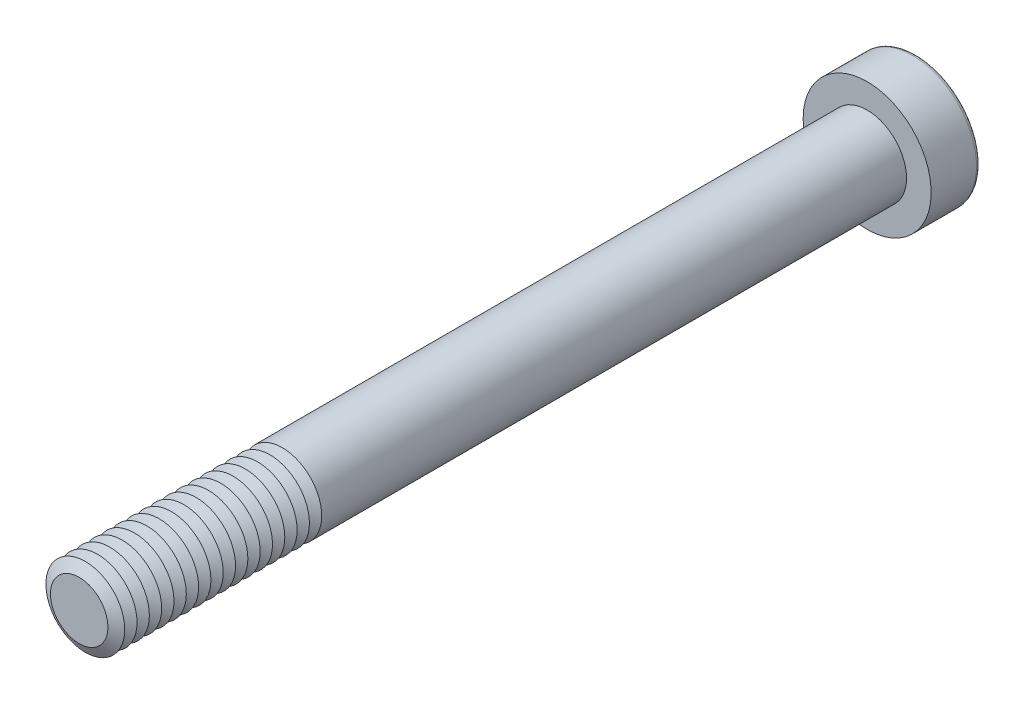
ISO-10303-21;
HEADER;
FILE_DESCRIPTION(('STEP AP214'),'2;1');
FILE_NAME('part.step','',(''),(''),'','','');
FILE_SCHEMA(('AUTOMOTIVE_DESIGN { 1 0 10303 214 1 1 1 1 }'));
ENDSEC;
DATA;
#1=APPLICATION_CONTEXT('core data for automotive mechanical design processes');
#2=APPLICATION_PROTOCOL_DEFINITION('international standard','automotive_design',2000,#1);
#3=PRODUCT_CONTEXT('',#1,'mechanical');
#4=PRODUCT('Part','Part','',(#3));
#5=PRODUCT_RELATED_PRODUCT_CATEGORY('part','',(#4));
#6=PRODUCT_DEFINITION_FORMATION('','',#4);
#7=PRODUCT_DEFINITION_CONTEXT('part definition',#1,'design');
#8=PRODUCT_DEFINITION('design','',#6,#7);
#9=PRODUCT_DEFINITION_SHAPE('','',#8);
#10=(LENGTH_UNIT() NAMED_UNIT(*) SI_UNIT(.MILLI.,.METRE.));
#11=(NAMED_UNIT(*) PLANE_ANGLE_UNIT() SI_UNIT($,.RADIAN.));
#12=(NAMED_UNIT(*) SI_UNIT($,.STERADIAN.) SOLID_ANGLE_UNIT());
#13=UNCERTAINTY_MEASURE_WITH_UNIT(LENGTH_MEASURE(1.E-05),#10,'distance_accuracy_value','');
#14=(GEOMETRIC_REPRESENTATION_CONTEXT(3) GLOBAL_UNCERTAINTY_ASSIGNED_CONTEXT((#13)) GLOBAL_UNIT_ASSIGNED_CONTEXT((#10,
#11,#12)) REPRESENTATION_CONTEXT('',''));
#15=CARTESIAN_POINT('',(0.,0.,0.));
#16=DIRECTION('',(0.,0.,1.));
#17=DIRECTION('',(1.,0.,0.));
#18=AXIS2_PLACEMENT_3D('',#15,#16,#17);
#19=CARTESIAN_POINT('',(0.,0.,75.625));
#20=DIRECTION('',(0.,0.,1.));
#21=DIRECTION('',(1.,0.,0.));
#22=AXIS2_PLACEMENT_3D('',#19,#20,#21);
#23=CONICAL_SURFACE('',#22,4.,1.0471975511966);
#24=CARTESIAN_POINT('',(0.,0.,75.));
#25=DIRECTION('',(0.,0.,1.));
#26=DIRECTION('',(1.,0.,0.));
#27=AXIS2_PLACEMENT_3D('',#24,#25,#26);
#28=CIRCLE('',#27,2.91746824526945);
#29=CARTESIAN_POINT('',(2.91746824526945,0.,75.));
#30=VERTEX_POINT('',#29);
#31=EDGE_CURVE('E314',#30,#30,#28,.T.);
#32=ORIENTED_EDGE('',*,*,#31,.T.);
#33=EDGE_LOOP('',(#32));
#34=FACE_BOUND('',#33,.T.);
#35=CARTESIAN_POINT('',(0.,0.,75.625));
#36=DIRECTION('',(0.,0.,1.));
#37=DIRECTION('',(1.,0.,0.));
#38=AXIS2_PLACEMENT_3D('',#35,#36,#37);
#39=CIRCLE('',#38,4.);
#40=CARTESIAN_POINT('',(4.,0.,75.625));
#41=VERTEX_POINT('',#40);
#42=EDGE_CURVE('E317',#41,#41,#39,.T.);
#43=ORIENTED_EDGE('',*,*,#42,.F.);
#44=EDGE_LOOP('',(#43));
#45=FACE_BOUND('',#44,.T.);
#46=ADVANCED_FACE('F39',(#34,#45),#23,.T.);
#47=CARTESIAN_POINT('',(0.,0.,75.));
#48=DIRECTION('',(0.,0.,-1.));
#49=DIRECTION('',(-1.,0.,0.));
#50=AXIS2_PLACEMENT_3D('',#47,#48,#49);
#51=CONICAL_SURFACE('',#50,2.91746824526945,1.0471975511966);
#52=CARTESIAN_POINT('',(0.,0.,74.375));
#53=DIRECTION('',(0.,0.,1.));
#54=DIRECTION('',(1.,0.,0.));
#55=AXIS2_PLACEMENT_3D('',#52,#53,#54);
#56=CIRCLE('',#55,4.);
#57=CARTESIAN_POINT('',(4.,0.,74.375));
#58=VERTEX_POINT('',#57);
#59=EDGE_CURVE('E325',#58,#58,#56,.T.);
#60=ORIENTED_EDGE('',*,*,#59,.T.);
#61=EDGE_LOOP('',(#60));
#62=FACE_BOUND('',#61,.T.);
#63=ORIENTED_EDGE('',*,*,#31,.F.);
#64=EDGE_LOOP('',(#63));
#65=FACE_BOUND('',#64,.T.);
#66=ADVANCED_FACE('F245',(#62,#65),#51,.T.);
#67=CARTESIAN_POINT('',(0.,0.,80.));
#68=DIRECTION('',(0.,0.,1.));
#69=DIRECTION('',(1.,0.,0.));
#70=AXIS2_PLACEMENT_3D('',#67,#68,#69);
#71=PLANE('',#70);
#72=CARTESIAN_POINT('',(0.,0.,80.));
#73=DIRECTION('',(0.,0.,1.));
#74=DIRECTION('',(1.,0.,0.));
#75=AXIS2_PLACEMENT_3D('',#72,#73,#74);
#76=CIRCLE('',#75,2.91746824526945);
#77=CARTESIAN_POINT('',(2.91746824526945,0.,80.));
#78=VERTEX_POINT('',#77);
#79=EDGE_CURVE('E174',#78,#78,#76,.T.);
#80=ORIENTED_EDGE('',*,*,#79,.T.);
#81=EDGE_LOOP('',(#80));
#82=FACE_BOUND('',#81,.T.);
#83=ADVANCED_FACE('F251',(#82),#71,.T.);
#84=CARTESIAN_POINT('',(0.,0.,80.));
#85=DIRECTION('',(0.,0.,-1.));
#86=DIRECTION('',(-1.,0.,0.));
#87=AXIS2_PLACEMENT_3D('',#84,#85,#86);
#88=CONICAL_SURFACE('',#87,2.91746824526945,1.0471975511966);
#89=CARTESIAN_POINT('',(0.,0.,79.375));
#90=DIRECTION('',(0.,0.,1.));
#91=DIRECTION('',(1.,0.,0.));
#92=AXIS2_PLACEMENT_3D('',#89,#90,#91);
#93=CIRCLE('',#92,4.);
#94=CARTESIAN_POINT('',(4.,0.,79.375));
#95=VERTEX_POINT('',#94);
#96=EDGE_CURVE('E291',#95,#95,#93,.T.);
#97=ORIENTED_EDGE('',*,*,#96,.T.);
#98=EDGE_LOOP('',(#97));
#99=FACE_BOUND('',#98,.T.);
#100=ORIENTED_EDGE('',*,*,#79,.F.);
#101=EDGE_LOOP('',(#100));
#102=FACE_BOUND('',#101,.T.);
#103=ADVANCED_FACE('F199',(#99,#102),#88,.T.);
#104=CARTESIAN_POINT('',(0.,0.,79.375));
#105=DIRECTION('',(0.,0.,1.));
#106=DIRECTION('',(1.,0.,0.));
#107=AXIS2_PLACEMENT_3D('',#104,#105,#106);
#108=CONICAL_SURFACE('',#107,4.,1.0471975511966);
#109=CARTESIAN_POINT('',(0.,0.,78.75));
#110=DIRECTION('',(0.,0.,1.));
#111=DIRECTION('',(1.,0.,0.));
#112=AXIS2_PLACEMENT_3D('',#109,#110,#111);
#113=CIRCLE('',#112,2.91746824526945);
#114=CARTESIAN_POINT('',(2.91746824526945,0.,78.75));
#115=VERTEX_POINT('',#114);
#116=EDGE_CURVE('E288',#115,#115,#113,.T.);
#117=ORIENTED_EDGE('',*,*,#116,.T.);
#118=EDGE_LOOP('',(#117));
#119=FACE_BOUND('',#118,.T.);
#120=ORIENTED_EDGE('',*,*,#96,.F.);
#121=EDGE_LOOP('',(#120));
#122=FACE_BOUND('',#121,.T.);
#123=ADVANCED_FACE('F277',(#119,#122),#108,.T.);
#124=CARTESIAN_POINT('',(0.,0.,78.75));
#125=DIRECTION('',(0.,0.,-1.));
#126=DIRECTION('',(-1.,0.,0.));
#127=AXIS2_PLACEMENT_3D('',#124,#125,#126);
#128=CONICAL_SURFACE('',#127,2.91746824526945,1.0471975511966);
#129=CARTESIAN_POINT('',(0.,0.,78.125));
#130=DIRECTION('',(0.,0.,1.));
#131=DIRECTION('',(1.,0.,0.));
#132=AXIS2_PLACEMENT_3D('',#129,#130,#131);
#133=CIRCLE('',#132,4.);
#134=CARTESIAN_POINT('',(4.,0.,78.125));
#135=VERTEX_POINT('',#134);
#136=EDGE_CURVE('E300',#135,#135,#133,.T.);
#137=ORIENTED_EDGE('',*,*,#136,.T.);
#138=EDGE_LOOP('',(#137));
#139=FACE_BOUND('',#138,.T.);
#140=ORIENTED_EDGE('',*,*,#116,.F.);
#141=EDGE_LOOP('',(#140));
#142=FACE_BOUND('',#141,.T.);
#143=ADVANCED_FACE('F274',(#139,#142),#128,.T.);
#144=CARTESIAN_POINT('',(0.,0.,78.125));
#145=DIRECTION('',(0.,0.,1.));
#146=DIRECTION('',(1.,0.,0.));
#147=AXIS2_PLACEMENT_3D('',#144,#145,#146);
#148=CONICAL_SURFACE('',#147,4.,1.0471975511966);
#149=CARTESIAN_POINT('',(0.,0.,77.5));
#150=DIRECTION('',(0.,0.,1.));
#151=DIRECTION('',(1.,0.,0.));
#152=AXIS2_PLACEMENT_3D('',#149,#150,#151);
#153=CIRCLE('',#152,2.91746824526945);
#154=CARTESIAN_POINT('',(2.91746824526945,0.,77.5));
#155=VERTEX_POINT('',#154);
#156=EDGE_CURVE('E293',#155,#155,#153,.T.);
#157=ORIENTED_EDGE('',*,*,#156,.T.);
#158=EDGE_LOOP('',(#157));
#159=FACE_BOUND('',#158,.T.);
#160=ORIENTED_EDGE('',*,*,#136,.F.);
#161=EDGE_LOOP('',(#160));
#162=FACE_BOUND('',#161,.T.);
#163=ADVANCED_FACE('F270',(#159,#162),#148,.T.);
#164=CARTESIAN_POINT('',(0.,0.,77.5));
#165=DIRECTION('',(0.,0.,-1.));
#166=DIRECTION('',(-1.,0.,0.));
#167=AXIS2_PLACEMENT_3D('',#164,#165,#166);
#168=CONICAL_SURFACE('',#167,2.91746824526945,1.0471975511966);
#169=CARTESIAN_POINT('',(0.,0.,76.875));
#170=DIRECTION('',(0.,0.,1.));
#171=DIRECTION('',(1.,0.,0.));
#172=AXIS2_PLACEMENT_3D('',#169,#170,#171);
#173=CIRCLE('',#172,4.);
#174=CARTESIAN_POINT('',(4.,0.,76.875));
#175=VERTEX_POINT('',#174);
#176=EDGE_CURVE('E310',#175,#175,#173,.T.);
#177=ORIENTED_EDGE('',*,*,#176,.T.);
#178=EDGE_LOOP('',(#177));
#179=FACE_BOUND('',#178,.T.);
#180=ORIENTED_EDGE('',*,*,#156,.F.);
#181=EDGE_LOOP('',(#180));
#182=FACE_BOUND('',#181,.T.);
#183=ADVANCED_FACE('F266',(#179,#182),#168,.T.);
#184=CARTESIAN_POINT('',(0.,0.,76.875));
#185=DIRECTION('',(0.,0.,1.));
#186=DIRECTION('',(1.,0.,0.));
#187=AXIS2_PLACEMENT_3D('',#184,#185,#186);
#188=CONICAL_SURFACE('',#187,4.,1.0471975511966);
#189=CARTESIAN_POINT('',(0.,0.,76.25));
#190=DIRECTION('',(0.,0.,1.));
#191=DIRECTION('',(1.,0.,0.));
#192=AXIS2_PLACEMENT_3D('',#189,#190,#191);
#193=CIRCLE('',#192,2.91746824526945);
#194=CARTESIAN_POINT('',(2.91746824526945,0.,76.25));
#195=VERTEX_POINT('',#194);
#196=EDGE_CURVE('E306',#195,#195,#193,.T.);
#197=ORIENTED_EDGE('',*,*,#196,.T.);
#198=EDGE_LOOP('',(#197));
#199=FACE_BOUND('',#198,.T.);
#200=ORIENTED_EDGE('',*,*,#176,.F.);
#201=EDGE_LOOP('',(#200));
#202=FACE_BOUND('',#201,.T.);
#203=ADVANCED_FACE('F262',(#199,#202),#188,.T.);
#204=CARTESIAN_POINT('',(0.,0.,76.25));
#205=DIRECTION('',(0.,0.,-1.));
#206=DIRECTION('',(-1.,0.,0.));
#207=AXIS2_PLACEMENT_3D('',#204,#205,#206);
#208=CONICAL_SURFACE('',#207,2.91746824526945,1.0471975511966);
#209=ORIENTED_EDGE('',*,*,#42,.T.);
#210=EDGE_LOOP('',(#209));
#211=FACE_BOUND('',#210,.T.);
#212=ORIENTED_EDGE('',*,*,#196,.F.);
#213=EDGE_LOOP('',(#212));
#214=FACE_BOUND('',#213,.T.);
#215=ADVANCED_FACE('F258',(#211,#214),#208,.T.);
#216=CARTESIAN_POINT('',(0.,0.,74.375));
#217=DIRECTION('',(0.,0.,1.));
#218=DIRECTION('',(1.,0.,0.));
#219=AXIS2_PLACEMENT_3D('',#216,#217,#218);
#220=CONICAL_SURFACE('',#219,4.,1.0471975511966);
#221=CARTESIAN_POINT('',(0.,0.,73.75));
#222=DIRECTION('',(0.,0.,1.));
#223=DIRECTION('',(1.,0.,0.));
#224=AXIS2_PLACEMENT_3D('',#221,#222,#223);
#225=CIRCLE('',#224,2.91746824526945);
#226=CARTESIAN_POINT('',(2.91746824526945,0.,73.75));
#227=VERTEX_POINT('',#226);
#228=EDGE_CURVE('E321',#227,#227,#225,.T.);
#229=ORIENTED_EDGE('',*,*,#228,.T.);
#230=EDGE_LOOP('',(#229));
#231=FACE_BOUND('',#230,.T.);
#232=ORIENTED_EDGE('',*,*,#59,.F.);
#233=EDGE_LOOP('',(#232));
#234=FACE_BOUND('',#233,.T.);
#235=ADVANCED_FACE('F261',(#231,#234),#220,.T.);
#236=CARTESIAN_POINT('',(0.,0.,73.75));
#237=DIRECTION('',(0.,0.,-1.));
#238=DIRECTION('',(-1.,0.,0.));
#239=AXIS2_PLACEMENT_3D('',#236,#237,#238);
#240=CONICAL_SURFACE('',#239,2.91746824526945,1.0471975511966);
#241=CARTESIAN_POINT('',(0.,0.,73.125));
#242=DIRECTION('',(0.,0.,1.));
#243=DIRECTION('',(1.,0.,0.));
#244=AXIS2_PLACEMENT_3D('',#241,#242,#243);
#245=CIRCLE('',#244,4.);
#246=CARTESIAN_POINT('',(4.,0.,73.125));
#247=VERTEX_POINT('',#246);
#248=EDGE_CURVE('E332',#247,#247,#245,.T.);
#249=ORIENTED_EDGE('',*,*,#248,.T.);
#250=EDGE_LOOP('',(#249));
#251=FACE_BOUND('',#250,.T.);
#252=ORIENTED_EDGE('',*,*,#228,.F.);
#253=EDGE_LOOP('',(#252));
#254=FACE_BOUND('',#253,.T.);
#255=ADVANCED_FACE('F512',(#251,#254),#240,.T.);
#256=CARTESIAN_POINT('',(0.,0.,73.125));
#257=DIRECTION('',(0.,0.,1.));
#258=DIRECTION('',(1.,0.,0.));
#259=AXIS2_PLACEMENT_3D('',#256,#257,#258);
#260=CONICAL_SURFACE('',#259,4.,1.0471975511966);
#261=CARTESIAN_POINT('',(0.,0.,72.5));
#262=DIRECTION('',(0.,0.,1.));
#263=DIRECTION('',(1.,0.,0.));
#264=AXIS2_PLACEMENT_3D('',#261,#262,#263);
#265=CIRCLE('',#264,2.91746824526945);
#266=CARTESIAN_POINT('',(2.91746824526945,0.,72.5));
#267=VERTEX_POINT('',#266);
#268=EDGE_CURVE('E328',#267,#267,#265,.T.);
#269=ORIENTED_EDGE('',*,*,#268,.T.);
#270=EDGE_LOOP('',(#269));
#271=FACE_BOUND('',#270,.T.);
#272=ORIENTED_EDGE('',*,*,#248,.F.);
#273=EDGE_LOOP('',(#272));
#274=FACE_BOUND('',#273,.T.);
#275=ADVANCED_FACE('F508',(#271,#274),#260,.T.);
#276=CARTESIAN_POINT('',(0.,0.,72.5));
#277=DIRECTION('',(0.,0.,-1.));
#278=DIRECTION('',(-1.,0.,0.));
#279=AXIS2_PLACEMENT_3D('',#276,#277,#278);
#280=CONICAL_SURFACE('',#279,2.91746824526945,1.0471975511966);
#281=CARTESIAN_POINT('',(0.,0.,71.875));
#282=DIRECTION('',(0.,0.,1.));
#283=DIRECTION('',(1.,0.,0.));
#284=AXIS2_PLACEMENT_3D('',#281,#282,#283);
#285=CIRCLE('',#284,4.);
#286=CARTESIAN_POINT('',(4.,0.,71.875));
#287=VERTEX_POINT('',#286);
#288=EDGE_CURVE('E340',#287,#287,#285,.T.);
#289=ORIENTED_EDGE('',*,*,#288,.T.);
#290=EDGE_LOOP('',(#289));
#291=FACE_BOUND('',#290,.T.);
#292=ORIENTED_EDGE('',*,*,#268,.F.);
#293=EDGE_LOOP('',(#292));
#294=FACE_BOUND('',#293,.T.);
#295=ADVANCED_FACE('F504',(#291,#294),#280,.T.);
#296=CARTESIAN_POINT('',(0.,0.,71.875));
#297=DIRECTION('',(0.,0.,1.));
#298=DIRECTION('',(1.,0.,0.));
#299=AXIS2_PLACEMENT_3D('',#296,#297,#298);
#300=CONICAL_SURFACE('',#299,4.,1.0471975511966);
#301=CARTESIAN_POINT('',(0.,0.,71.25));
#302=DIRECTION('',(0.,0.,1.));
#303=DIRECTION('',(1.,0.,0.));
#304=AXIS2_PLACEMENT_3D('',#301,#302,#303);
#305=CIRCLE('',#304,2.91746824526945);
#306=CARTESIAN_POINT('',(2.91746824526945,0.,71.25));
#307=VERTEX_POINT('',#306);
#308=EDGE_CURVE('E336',#307,#307,#305,.T.);
#309=ORIENTED_EDGE('',*,*,#308,.T.);
#310=EDGE_LOOP('',(#309));
#311=FACE_BOUND('',#310,.T.);
#312=ORIENTED_EDGE('',*,*,#288,.F.);
#313=EDGE_LOOP('',(#312));
#314=FACE_BOUND('',#313,.T.);
#315=ADVANCED_FACE('F500',(#311,#314),#300,.T.);
#316=CARTESIAN_POINT('',(0.,0.,71.25));
#317=DIRECTION('',(0.,0.,-1.));
#318=DIRECTION('',(-1.,0.,0.));
#319=AXIS2_PLACEMENT_3D('',#316,#317,#318);
#320=CONICAL_SURFACE('',#319,2.91746824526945,1.0471975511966);
#321=CARTESIAN_POINT('',(0.,0.,70.625));
#322=DIRECTION('',(0.,0.,1.));
#323=DIRECTION('',(1.,0.,0.));
#324=AXIS2_PLACEMENT_3D('',#321,#322,#323);
#325=CIRCLE('',#324,4.);
#326=CARTESIAN_POINT('',(4.,0.,70.625));
#327=VERTEX_POINT('',#326);
#328=EDGE_CURVE('E348',#327,#327,#325,.T.);
#329=ORIENTED_EDGE('',*,*,#328,.T.);
#330=EDGE_LOOP('',(#329));
#331=FACE_BOUND('',#330,.T.);
#332=ORIENTED_EDGE('',*,*,#308,.F.);
#333=EDGE_LOOP('',(#332));
#334=FACE_BOUND('',#333,.T.);
#335=ADVANCED_FACE('F496',(#331,#334),#320,.T.);
#336=CARTESIAN_POINT('',(0.,0.,70.625));
#337=DIRECTION('',(0.,0.,1.));
#338=DIRECTION('',(1.,0.,0.));
#339=AXIS2_PLACEMENT_3D('',#336,#337,#338);
#340=CONICAL_SURFACE('',#339,4.,1.0471975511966);
#341=CARTESIAN_POINT('',(0.,0.,70.));
#342=DIRECTION('',(0.,0.,1.));
#343=DIRECTION('',(1.,0.,0.));
#344=AXIS2_PLACEMENT_3D('',#341,#342,#343);
#345=CIRCLE('',#344,2.91746824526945);
#346=CARTESIAN_POINT('',(2.91746824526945,0.,70.));
#347=VERTEX_POINT('',#346);
#348=EDGE_CURVE('E344',#347,#347,#345,.T.);
#349=ORIENTED_EDGE('',*,*,#348,.T.);
#350=EDGE_LOOP('',(#349));
#351=FACE_BOUND('',#350,.T.);
#352=ORIENTED_EDGE('',*,*,#328,.F.);
#353=EDGE_LOOP('',(#352));
#354=FACE_BOUND('',#353,.T.);
#355=ADVANCED_FACE('F492',(#351,#354),#340,.T.);
#356=CARTESIAN_POINT('',(0.,0.,70.));
#357=DIRECTION('',(0.,0.,-1.));
#358=DIRECTION('',(-1.,0.,0.));
#359=AXIS2_PLACEMENT_3D('',#356,#357,#358);
#360=CONICAL_SURFACE('',#359,2.91746824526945,1.0471975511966);
#361=CARTESIAN_POINT('',(0.,0.,69.375));
#362=DIRECTION('',(0.,0.,1.));
#363=DIRECTION('',(1.,0.,0.));
#364=AXIS2_PLACEMENT_3D('',#361,#362,#363);
#365=CIRCLE('',#364,4.);
#366=CARTESIAN_POINT('',(4.,0.,69.375));
#367=VERTEX_POINT('',#366);
#368=EDGE_CURVE('E356',#367,#367,#365,.T.);
#369=ORIENTED_EDGE('',*,*,#368,.T.);
#370=EDGE_LOOP('',(#369));
#371=FACE_BOUND('',#370,.T.);
#372=ORIENTED_EDGE('',*,*,#348,.F.);
#373=EDGE_LOOP('',(#372));
#374=FACE_BOUND('',#373,.T.);
#375=ADVANCED_FACE('F488',(#371,#374),#360,.T.);
#376=CARTESIAN_POINT('',(0.,0.,69.375));
#377=DIRECTION('',(0.,0.,1.));
#378=DIRECTION('',(1.,0.,0.));
#379=AXIS2_PLACEMENT_3D('',#376,#377,#378);
#380=CONICAL_SURFACE('',#379,4.,1.0471975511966);
#381=CARTESIAN_POINT('',(0.,0.,68.75));
#382=DIRECTION('',(0.,0.,1.));
#383=DIRECTION('',(1.,0.,0.));
#384=AXIS2_PLACEMENT_3D('',#381,#382,#383);
#385=CIRCLE('',#384,2.91746824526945);
#386=CARTESIAN_POINT('',(2.91746824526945,0.,68.75));
#387=VERTEX_POINT('',#386);
#388=EDGE_CURVE('E352',#387,#387,#385,.T.);
#389=ORIENTED_EDGE('',*,*,#388,.T.);
#390=EDGE_LOOP('',(#389));
#391=FACE_BOUND('',#390,.T.);
#392=ORIENTED_EDGE('',*,*,#368,.F.);
#393=EDGE_LOOP('',(#392));
#394=FACE_BOUND('',#393,.T.);
#395=ADVANCED_FACE('F484',(#391,#394),#380,.T.);
#396=CARTESIAN_POINT('',(0.,0.,68.75));
#397=DIRECTION('',(0.,0.,-1.));
#398=DIRECTION('',(-1.,0.,0.));
#399=AXIS2_PLACEMENT_3D('',#396,#397,#398);
#400=CONICAL_SURFACE('',#399,2.91746824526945,1.0471975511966);
#401=CARTESIAN_POINT('',(0.,0.,68.125));
#402=DIRECTION('',(0.,0.,1.));
#403=DIRECTION('',(1.,0.,0.));
#404=AXIS2_PLACEMENT_3D('',#401,#402,#403);
#405=CIRCLE('',#404,4.);
#406=CARTESIAN_POINT('',(4.,0.,68.125));
#407=VERTEX_POINT('',#406);
#408=EDGE_CURVE('E364',#407,#407,#405,.T.);
#409=ORIENTED_EDGE('',*,*,#408,.T.);
#410=EDGE_LOOP('',(#409));
#411=FACE_BOUND('',#410,.T.);
#412=ORIENTED_EDGE('',*,*,#388,.F.);
#413=EDGE_LOOP('',(#412));
#414=FACE_BOUND('',#413,.T.);
#415=ADVANCED_FACE('F480',(#411,#414),#400,.T.);
#416=CARTESIAN_POINT('',(0.,0.,68.125));
#417=DIRECTION('',(0.,0.,1.));
#418=DIRECTION('',(1.,0.,0.));
#419=AXIS2_PLACEMENT_3D('',#416,#417,#418);
#420=CONICAL_SURFACE('',#419,4.,1.0471975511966);
#421=CARTESIAN_POINT('',(0.,0.,67.5));
#422=DIRECTION('',(0.,0.,1.));
#423=DIRECTION('',(1.,0.,0.));
#424=AXIS2_PLACEMENT_3D('',#421,#422,#423);
#425=CIRCLE('',#424,2.91746824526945);
#426=CARTESIAN_POINT('',(2.91746824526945,0.,67.5));
#427=VERTEX_POINT('',#426);
#428=EDGE_CURVE('E360',#427,#427,#425,.T.);
#429=ORIENTED_EDGE('',*,*,#428,.T.);
#430=EDGE_LOOP('',(#429));
#431=FACE_BOUND('',#430,.T.);
#432=ORIENTED_EDGE('',*,*,#408,.F.);
#433=EDGE_LOOP('',(#432));
#434=FACE_BOUND('',#433,.T.);
#435=ADVANCED_FACE('F476',(#431,#434),#420,.T.);
#436=CARTESIAN_POINT('',(0.,0.,67.5));
#437=DIRECTION('',(0.,0.,-1.));
#438=DIRECTION('',(-1.,0.,0.));
#439=AXIS2_PLACEMENT_3D('',#436,#437,#438);
#440=CONICAL_SURFACE('',#439,2.91746824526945,1.0471975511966);
#441=CARTESIAN_POINT('',(0.,0.,66.875));
#442=DIRECTION('',(0.,0.,1.));
#443=DIRECTION('',(1.,0.,0.));
#444=AXIS2_PLACEMENT_3D('',#441,#442,#443);
#445=CIRCLE('',#444,4.);
#446=CARTESIAN_POINT('',(4.,0.,66.875));
#447=VERTEX_POINT('',#446);
#448=EDGE_CURVE('E372',#447,#447,#445,.T.);
#449=ORIENTED_EDGE('',*,*,#448,.T.);
#450=EDGE_LOOP('',(#449));
#451=FACE_BOUND('',#450,.T.);
#452=ORIENTED_EDGE('',*,*,#428,.F.);
#453=EDGE_LOOP('',(#452));
#454=FACE_BOUND('',#453,.T.);
#455=ADVANCED_FACE('F472',(#451,#454),#440,.T.);
#456=CARTESIAN_POINT('',(0.,0.,66.875));
#457=DIRECTION('',(0.,0.,1.));
#458=DIRECTION('',(1.,0.,0.));
#459=AXIS2_PLACEMENT_3D('',#456,#457,#458);
#460=CONICAL_SURFACE('',#459,4.,1.0471975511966);
#461=CARTESIAN_POINT('',(0.,0.,66.25));
#462=DIRECTION('',(0.,0.,1.));
#463=DIRECTION('',(1.,0.,0.));
#464=AXIS2_PLACEMENT_3D('',#461,#462,#463);
#465=CIRCLE('',#464,2.91746824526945);
#466=CARTESIAN_POINT('',(2.91746824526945,0.,66.25));
#467=VERTEX_POINT('',#466);
#468=EDGE_CURVE('E368',#467,#467,#465,.T.);
#469=ORIENTED_EDGE('',*,*,#468,.T.);
#470=EDGE_LOOP('',(#469));
#471=FACE_BOUND('',#470,.T.);
#472=ORIENTED_EDGE('',*,*,#448,.F.);
#473=EDGE_LOOP('',(#472));
#474=FACE_BOUND('',#473,.T.);
#475=ADVANCED_FACE('F468',(#471,#474),#460,.T.);
#476=CARTESIAN_POINT('',(0.,0.,66.25));
#477=DIRECTION('',(0.,0.,-1.));
#478=DIRECTION('',(-1.,0.,0.));
#479=AXIS2_PLACEMENT_3D('',#476,#477,#478);
#480=CONICAL_SURFACE('',#479,2.91746824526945,1.0471975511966);
#481=CARTESIAN_POINT('',(0.,0.,65.625));
#482=DIRECTION('',(0.,0.,1.));
#483=DIRECTION('',(1.,0.,0.));
#484=AXIS2_PLACEMENT_3D('',#481,#482,#483);
#485=CIRCLE('',#484,4.);
#486=CARTESIAN_POINT('',(4.,0.,65.625));
#487=VERTEX_POINT('',#486);
#488=EDGE_CURVE('E380',#487,#487,#485,.T.);
#489=ORIENTED_EDGE('',*,*,#488,.T.);
#490=EDGE_LOOP('',(#489));
#491=FACE_BOUND('',#490,.T.);
#492=ORIENTED_EDGE('',*,*,#468,.F.);
#493=EDGE_LOOP('',(#492));
#494=FACE_BOUND('',#493,.T.);
#495=ADVANCED_FACE('F464',(#491,#494),#480,.T.);
#496=CARTESIAN_POINT('',(0.,0.,65.625));
#497=DIRECTION('',(0.,0.,1.));
#498=DIRECTION('',(1.,0.,0.));
#499=AXIS2_PLACEMENT_3D('',#496,#497,#498);
#500=CONICAL_SURFACE('',#499,4.,1.0471975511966);
#501=CARTESIAN_POINT('',(0.,0.,65.));
#502=DIRECTION('',(0.,0.,1.));
#503=DIRECTION('',(1.,0.,0.));
#504=AXIS2_PLACEMENT_3D('',#501,#502,#503);
#505=CIRCLE('',#504,2.91746824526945);
#506=CARTESIAN_POINT('',(2.91746824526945,0.,65.));
#507=VERTEX_POINT('',#506);
#508=EDGE_CURVE('E376',#507,#507,#505,.T.);
#509=ORIENTED_EDGE('',*,*,#508,.T.);
#510=EDGE_LOOP('',(#509));
#511=FACE_BOUND('',#510,.T.);
#512=ORIENTED_EDGE('',*,*,#488,.F.);
#513=EDGE_LOOP('',(#512));
#514=FACE_BOUND('',#513,.T.);
#515=ADVANCED_FACE('F460',(#511,#514),#500,.T.);
#516=CARTESIAN_POINT('',(0.,0.,65.));
#517=DIRECTION('',(0.,0.,-1.));
#518=DIRECTION('',(-1.,0.,0.));
#519=AXIS2_PLACEMENT_3D('',#516,#517,#518);
#520=CONICAL_SURFACE('',#519,2.91746824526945,1.0471975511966);
#521=CARTESIAN_POINT('',(0.,0.,64.375));
#522=DIRECTION('',(0.,0.,1.));
#523=DIRECTION('',(1.,0.,0.));
#524=AXIS2_PLACEMENT_3D('',#521,#522,#523);
#525=CIRCLE('',#524,4.);
#526=CARTESIAN_POINT('',(4.,0.,64.375));
#527=VERTEX_POINT('',#526);
#528=EDGE_CURVE('E388',#527,#527,#525,.T.);
#529=ORIENTED_EDGE('',*,*,#528,.T.);
#530=EDGE_LOOP('',(#529));
#531=FACE_BOUND('',#530,.T.);
#532=ORIENTED_EDGE('',*,*,#508,.F.);
#533=EDGE_LOOP('',(#532));
#534=FACE_BOUND('',#533,.T.);
#535=ADVANCED_FACE('F456',(#531,#534),#520,.T.);
#536=CARTESIAN_POINT('',(0.,0.,64.375));
#537=DIRECTION('',(0.,0.,1.));
#538=DIRECTION('',(1.,0.,0.));
#539=AXIS2_PLACEMENT_3D('',#536,#537,#538);
#540=CONICAL_SURFACE('',#539,4.,1.0471975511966);
#541=CARTESIAN_POINT('',(0.,0.,63.75));
#542=DIRECTION('',(0.,0.,1.));
#543=DIRECTION('',(1.,0.,0.));
#544=AXIS2_PLACEMENT_3D('',#541,#542,#543);
#545=CIRCLE('',#544,2.91746824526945);
#546=CARTESIAN_POINT('',(2.91746824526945,0.,63.75));
#547=VERTEX_POINT('',#546);
#548=EDGE_CURVE('E384',#547,#547,#545,.T.);
#549=ORIENTED_EDGE('',*,*,#548,.T.);
#550=EDGE_LOOP('',(#549));
#551=FACE_BOUND('',#550,.T.);
#552=ORIENTED_EDGE('',*,*,#528,.F.);
#553=EDGE_LOOP('',(#552));
#554=FACE_BOUND('',#553,.T.);
#555=ADVANCED_FACE('F452',(#551,#554),#540,.T.);
#556=CARTESIAN_POINT('',(0.,0.,63.75));
#557=DIRECTION('',(0.,0.,-1.));
#558=DIRECTION('',(-1.,0.,0.));
#559=AXIS2_PLACEMENT_3D('',#556,#557,#558);
#560=CONICAL_SURFACE('',#559,2.91746824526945,1.0471975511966);
#561=CARTESIAN_POINT('',(0.,0.,63.125));
#562=DIRECTION('',(0.,0.,1.));
#563=DIRECTION('',(1.,0.,0.));
#564=AXIS2_PLACEMENT_3D('',#561,#562,#563);
#565=CIRCLE('',#564,4.);
#566=CARTESIAN_POINT('',(4.,0.,63.125));
#567=VERTEX_POINT('',#566);
#568=EDGE_CURVE('E396',#567,#567,#565,.T.);
#569=ORIENTED_EDGE('',*,*,#568,.T.);
#570=EDGE_LOOP('',(#569));
#571=FACE_BOUND('',#570,.T.);
#572=ORIENTED_EDGE('',*,*,#548,.F.);
#573=EDGE_LOOP('',(#572));
#574=FACE_BOUND('',#573,.T.);
#575=ADVANCED_FACE('F448',(#571,#574),#560,.T.);
#576=CARTESIAN_POINT('',(0.,0.,63.125));
#577=DIRECTION('',(0.,0.,1.));
#578=DIRECTION('',(1.,0.,0.));
#579=AXIS2_PLACEMENT_3D('',#576,#577,#578);
#580=CONICAL_SURFACE('',#579,4.,1.0471975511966);
#581=CARTESIAN_POINT('',(0.,0.,62.5));
#582=DIRECTION('',(0.,0.,1.));
#583=DIRECTION('',(1.,0.,0.));
#584=AXIS2_PLACEMENT_3D('',#581,#582,#583);
#585=CIRCLE('',#584,2.91746824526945);
#586=CARTESIAN_POINT('',(2.91746824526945,0.,62.5));
#587=VERTEX_POINT('',#586);
#588=EDGE_CURVE('E392',#587,#587,#585,.T.);
#589=ORIENTED_EDGE('',*,*,#588,.T.);
#590=EDGE_LOOP('',(#589));
#591=FACE_BOUND('',#590,.T.);
#592=ORIENTED_EDGE('',*,*,#568,.F.);
#593=EDGE_LOOP('',(#592));
#594=FACE_BOUND('',#593,.T.);
#595=ADVANCED_FACE('F444',(#591,#594),#580,.T.);
#596=CARTESIAN_POINT('',(0.,0.,62.5));
#597=DIRECTION('',(0.,0.,-1.));
#598=DIRECTION('',(-1.,0.,0.));
#599=AXIS2_PLACEMENT_3D('',#596,#597,#598);
#600=CONICAL_SURFACE('',#599,2.91746824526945,1.0471975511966);
#601=CARTESIAN_POINT('',(0.,0.,61.875));
#602=DIRECTION('',(0.,0.,1.));
#603=DIRECTION('',(1.,0.,0.));
#604=AXIS2_PLACEMENT_3D('',#601,#602,#603);
#605=CIRCLE('',#604,4.);
#606=CARTESIAN_POINT('',(4.,0.,61.875));
#607=VERTEX_POINT('',#606);
#608=EDGE_CURVE('E404',#607,#607,#605,.T.);
#609=ORIENTED_EDGE('',*,*,#608,.T.);
#610=EDGE_LOOP('',(#609));
#611=FACE_BOUND('',#610,.T.);
#612=ORIENTED_EDGE('',*,*,#588,.F.);
#613=EDGE_LOOP('',(#612));
#614=FACE_BOUND('',#613,.T.);
#615=ADVANCED_FACE('F440',(#611,#614),#600,.T.);
#616=CARTESIAN_POINT('',(0.,0.,61.875));
#617=DIRECTION('',(0.,0.,1.));
#618=DIRECTION('',(1.,0.,0.));
#619=AXIS2_PLACEMENT_3D('',#616,#617,#618);
#620=CONICAL_SURFACE('',#619,4.,1.0471975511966);
#621=CARTESIAN_POINT('',(0.,0.,61.25));
#622=DIRECTION('',(0.,0.,1.));
#623=DIRECTION('',(1.,0.,0.));
#624=AXIS2_PLACEMENT_3D('',#621,#622,#623);
#625=CIRCLE('',#624,2.91746824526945);
#626=CARTESIAN_POINT('',(2.91746824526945,0.,61.25));
#627=VERTEX_POINT('',#626);
#628=EDGE_CURVE('E400',#627,#627,#625,.T.);
#629=ORIENTED_EDGE('',*,*,#628,.T.);
#630=EDGE_LOOP('',(#629));
#631=FACE_BOUND('',#630,.T.);
#632=ORIENTED_EDGE('',*,*,#608,.F.);
#633=EDGE_LOOP('',(#632));
#634=FACE_BOUND('',#633,.T.);
#635=ADVANCED_FACE('F435',(#631,#634),#620,.T.);
#636=CARTESIAN_POINT('',(0.,0.,61.25));
#637=DIRECTION('',(0.,0.,-1.));
#638=DIRECTION('',(-1.,0.,0.));
#639=AXIS2_PLACEMENT_3D('',#636,#637,#638);
#640=CONICAL_SURFACE('',#639,2.91746824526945,1.0471975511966);
#641=CARTESIAN_POINT('',(0.,0.,60.625));
#642=DIRECTION('',(0.,0.,1.));
#643=DIRECTION('',(1.,0.,0.));
#644=AXIS2_PLACEMENT_3D('',#641,#642,#643);
#645=CIRCLE('',#644,4.);
#646=CARTESIAN_POINT('',(4.,0.,60.625));
#647=VERTEX_POINT('',#646);
#648=EDGE_CURVE('E416',#647,#647,#645,.T.);
#649=ORIENTED_EDGE('',*,*,#648,.T.);
#650=EDGE_LOOP('',(#649));
#651=FACE_BOUND('',#650,.T.);
#652=ORIENTED_EDGE('',*,*,#628,.F.);
#653=EDGE_LOOP('',(#652));
#654=FACE_BOUND('',#653,.T.);
#655=ADVANCED_FACE('F421',(#651,#654),#640,.T.);
#656=CARTESIAN_POINT('',(0.,0.,60.625));
#657=DIRECTION('',(0.,0.,1.));
#658=DIRECTION('',(1.,0.,0.));
#659=AXIS2_PLACEMENT_3D('',#656,#657,#658);
#660=CONICAL_SURFACE('',#659,4.,1.0471975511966);
#661=CARTESIAN_POINT('',(0.,0.,60.));
#662=DIRECTION('',(0.,0.,1.));
#663=DIRECTION('',(1.,0.,0.));
#664=AXIS2_PLACEMENT_3D('',#661,#662,#663);
#665=CIRCLE('',#664,2.91746824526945);
#666=CARTESIAN_POINT('',(2.91746824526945,0.,60.));
#667=VERTEX_POINT('',#666);
#668=EDGE_CURVE('E408',#667,#667,#665,.T.);
#669=ORIENTED_EDGE('',*,*,#668,.T.);
#670=EDGE_LOOP('',(#669));
#671=FACE_BOUND('',#670,.T.);
#672=ORIENTED_EDGE('',*,*,#648,.F.);
#673=EDGE_LOOP('',(#672));
#674=FACE_BOUND('',#673,.T.);
#675=ADVANCED_FACE('F424',(#671,#674),#660,.T.);
#676=CARTESIAN_POINT('',(0.,0.,60.));
#677=DIRECTION('',(0.,0.,-1.));
#678=DIRECTION('',(-1.,0.,0.));
#679=AXIS2_PLACEMENT_3D('',#676,#677,#678);
#680=CONICAL_SURFACE('',#679,2.91746824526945,1.0471975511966);
#681=CARTESIAN_POINT('',(0.,0.,59.375));
#682=DIRECTION('',(0.,0.,1.));
#683=DIRECTION('',(1.,0.,0.));
#684=AXIS2_PLACEMENT_3D('',#681,#682,#683);
#685=CIRCLE('',#684,4.);
#686=CARTESIAN_POINT('',(4.,0.,59.375));
#687=VERTEX_POINT('',#686);
#688=EDGE_CURVE('E412',#687,#687,#685,.T.);
#689=ORIENTED_EDGE('',*,*,#688,.T.);
#690=EDGE_LOOP('',(#689));
#691=FACE_BOUND('',#690,.T.);
#692=ORIENTED_EDGE('',*,*,#668,.F.);
#693=EDGE_LOOP('',(#692));
#694=FACE_BOUND('',#693,.T.);
#695=ADVANCED_FACE('F426',(#691,#694),#680,.T.);
#696=CARTESIAN_POINT('',(0.,0.,-1.25));
#697=DIRECTION('',(0.,0.,-1.));
#698=DIRECTION('',(-1.,0.,0.));
#699=AXIS2_PLACEMENT_3D('',#696,#697,#698);
#700=CONICAL_SURFACE('',#699,2.5,1.0471975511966);
#701=CARTESIAN_POINT('',(0.,0.,0.193375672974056));
#702=VERTEX_POINT('',#701);
#703=VERTEX_LOOP('',#702);
#704=FACE_BOUND('',#703,.T.);
#705=CARTESIAN_POINT('',(0.,0.,-1.25));
#706=DIRECTION('',(0.,0.,-1.));
#707=DIRECTION('',(-1.,0.,0.));
#708=AXIS2_PLACEMENT_3D('',#705,#706,#707);
#709=CIRCLE('',#708,2.5);
#710=CARTESIAN_POINT('',(-2.1650635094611,1.25,-1.25));
#711=VERTEX_POINT('',#710);
#712=CARTESIAN_POINT('',(0.,2.5,-1.25));
#713=VERTEX_POINT('',#712);
#714=EDGE_CURVE('E149',#711,#713,#709,.T.);
#715=ORIENTED_EDGE('',*,*,#714,.T.);
#716=CARTESIAN_POINT('',(0.,0.,-1.25));
#717=DIRECTION('',(0.,0.,-1.));
#718=DIRECTION('',(-1.,0.,0.));
#719=AXIS2_PLACEMENT_3D('',#716,#717,#718);
#720=CIRCLE('',#719,2.5);
#721=CARTESIAN_POINT('',(2.1650635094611,1.25,-1.25));
#722=VERTEX_POINT('',#721);
#723=EDGE_CURVE('E54',#713,#722,#720,.T.);
#724=ORIENTED_EDGE('',*,*,#723,.T.);
#725=CARTESIAN_POINT('',(2.1650635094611,-1.25,-1.25));
#726=VERTEX_POINT('',#725);
#727=EDGE_CURVE('E1028',#722,#726,#720,.T.);
#728=ORIENTED_EDGE('',*,*,#727,.T.);
#729=CARTESIAN_POINT('',(0.,-2.5,-1.25));
#730=VERTEX_POINT('',#729);
#731=EDGE_CURVE('E1027',#726,#730,#720,.T.);
#732=ORIENTED_EDGE('',*,*,#731,.T.);
#733=CARTESIAN_POINT('',(-2.1650635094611,-1.25,-1.25));
#734=VERTEX_POINT('',#733);
#735=EDGE_CURVE('E1022',#730,#734,#720,.T.);
#736=ORIENTED_EDGE('',*,*,#735,.T.);
#737=EDGE_CURVE('E1020',#734,#711,#720,.T.);
#738=ORIENTED_EDGE('',*,*,#737,.T.);
#739=EDGE_LOOP('',(#715,#724,#728,#732,#736,#738));
#740=FACE_BOUND('',#739,.T.);
#741=ADVANCED_FACE('F201',(#704,#740),#700,.F.);
#742=CARTESIAN_POINT('',(0.,0.,-1.25));
#743=DIRECTION('',(0.,0.,-1.));
#744=DIRECTION('',(-1.,0.,0.));
#745=AXIS2_PLACEMENT_3D('',#742,#743,#744);
#746=PLANE('',#745);
#747=ORIENTED_EDGE('',*,*,#723,.F.);
#748=DIRECTION('',(1.,0.,0.));
#749=VECTOR('',#748,1.);
#750=CARTESIAN_POINT('',(-1.44337567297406,2.5,-1.25));
#751=LINE('',#750,#749);
#752=CARTESIAN_POINT('',(1.44337567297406,2.5,-1.25));
#753=VERTEX_POINT('',#752);
#754=EDGE_CURVE('E1065',#713,#753,#751,.T.);
#755=ORIENTED_EDGE('',*,*,#754,.T.);
#756=DIRECTION('',(0.5,-0.866025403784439,0.));
#757=VECTOR('',#756,1.);
#758=CARTESIAN_POINT('',(1.44337567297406,2.5,-1.25));
#759=LINE('',#758,#757);
#760=EDGE_CURVE('E155',#753,#722,#759,.T.);
#761=ORIENTED_EDGE('',*,*,#760,.T.);
#762=EDGE_LOOP('',(#747,#755,#761));
#763=FACE_BOUND('',#762,.T.);
#764=ADVANCED_FACE('F607',(#763),#746,.T.);
#765=ORIENTED_EDGE('',*,*,#727,.F.);
#766=CARTESIAN_POINT('',(2.88675134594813,0.,-1.25));
#767=VERTEX_POINT('',#766);
#768=EDGE_CURVE('E1066',#722,#767,#759,.T.);
#769=ORIENTED_EDGE('',*,*,#768,.T.);
#770=DIRECTION('',(-0.5,-0.866025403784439,0.));
#771=VECTOR('',#770,1.);
#772=CARTESIAN_POINT('',(2.88675134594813,0.,-1.25));
#773=LINE('',#772,#771);
#774=EDGE_CURVE('E1040',#767,#726,#773,.T.);
#775=ORIENTED_EDGE('',*,*,#774,.T.);
#776=EDGE_LOOP('',(#765,#769,#775));
#777=FACE_BOUND('',#776,.T.);
#778=ADVANCED_FACE('F617',(#777),#746,.T.);
#779=ORIENTED_EDGE('',*,*,#731,.F.);
#780=CARTESIAN_POINT('',(1.44337567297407,-2.5,-1.25));
#781=VERTEX_POINT('',#780);
#782=EDGE_CURVE('E1042',#726,#781,#773,.T.);
#783=ORIENTED_EDGE('',*,*,#782,.T.);
#784=DIRECTION('',(-1.,0.,0.));
#785=VECTOR('',#784,1.);
#786=CARTESIAN_POINT('',(1.44337567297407,-2.5,-1.25));
#787=LINE('',#786,#785);
#788=EDGE_CURVE('E994',#781,#730,#787,.T.);
#789=ORIENTED_EDGE('',*,*,#788,.T.);
#790=EDGE_LOOP('',(#779,#783,#789));
#791=FACE_BOUND('',#790,.T.);
#792=ADVANCED_FACE('F627',(#791),#746,.T.);
#793=ORIENTED_EDGE('',*,*,#735,.F.);
#794=CARTESIAN_POINT('',(-1.44337567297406,-2.5,-1.25));
#795=VERTEX_POINT('',#794);
#796=EDGE_CURVE('E1037',#730,#795,#787,.T.);
#797=ORIENTED_EDGE('',*,*,#796,.T.);
#798=DIRECTION('',(-0.5,0.866025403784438,0.));
#799=VECTOR('',#798,1.);
#800=CARTESIAN_POINT('',(-1.44337567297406,-2.5,-1.25));
#801=LINE('',#800,#799);
#802=EDGE_CURVE('E1039',#795,#734,#801,.T.);
#803=ORIENTED_EDGE('',*,*,#802,.T.);
#804=EDGE_LOOP('',(#793,#797,#803));
#805=FACE_BOUND('',#804,.T.);
#806=ADVANCED_FACE('F635',(#805),#746,.T.);
#807=ORIENTED_EDGE('',*,*,#737,.F.);
#808=CARTESIAN_POINT('',(-2.88675134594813,0.,-1.25));
#809=VERTEX_POINT('',#808);
#810=EDGE_CURVE('E1043',#734,#809,#801,.T.);
#811=ORIENTED_EDGE('',*,*,#810,.T.);
#812=DIRECTION('',(0.5,0.866025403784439,0.));
#813=VECTOR('',#812,1.);
#814=CARTESIAN_POINT('',(-2.88675134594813,0.,-1.25));
#815=LINE('',#814,#813);
#816=EDGE_CURVE('E158',#809,#711,#815,.T.);
#817=ORIENTED_EDGE('',*,*,#816,.T.);
#818=EDGE_LOOP('',(#807,#811,#817));
#819=FACE_BOUND('',#818,.T.);
#820=ADVANCED_FACE('F231',(#819),#746,.T.);
#821=ORIENTED_EDGE('',*,*,#714,.F.);
#822=CARTESIAN_POINT('',(-1.44337567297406,2.5,-1.25));
#823=VERTEX_POINT('',#822);
#824=EDGE_CURVE('E1050',#711,#823,#815,.T.);
#825=ORIENTED_EDGE('',*,*,#824,.T.);
#826=EDGE_CURVE('E1064',#823,#713,#751,.T.);
#827=ORIENTED_EDGE('',*,*,#826,.T.);
#828=EDGE_LOOP('',(#821,#825,#827));
#829=FACE_BOUND('',#828,.T.);
#830=ADVANCED_FACE('F619',(#829),#746,.T.);
#831=CARTESIAN_POINT('',(-1.44337567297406,2.5,-1.25));
#832=DIRECTION('',(0.,1.,0.));
#833=DIRECTION('',(-1.,0.,0.));
#834=AXIS2_PLACEMENT_3D('',#831,#832,#833);
#835=PLANE('',#834);
#836=DIRECTION('',(0.,0.,-1.));
#837=VECTOR('',#836,1.);
#838=CARTESIAN_POINT('',(-1.44337567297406,2.5,-1.25));
#839=LINE('',#838,#837);
#840=CARTESIAN_POINT('',(-1.44337567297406,2.5,-5.));
#841=VERTEX_POINT('',#840);
#842=EDGE_CURVE('E147',#823,#841,#839,.T.);
#843=ORIENTED_EDGE('',*,*,#842,.T.);
#844=CARTESIAN_POINT('',(-3.76800948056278,2.5,-5.43814611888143));
#845=CARTESIAN_POINT('',(-3.65512241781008,2.5,-5.41294788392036));
#846=CARTESIAN_POINT('',(-3.54216337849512,2.5,-5.38806689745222));
#847=CARTESIAN_POINT('',(-3.31606595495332,2.5,-5.33910944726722));
#848=CARTESIAN_POINT('',(-3.202927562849,2.5,-5.31503301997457));
#849=CARTESIAN_POINT('',(-2.97632910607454,2.5,-5.26783262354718));
#850=CARTESIAN_POINT('',(-2.86286882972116,2.5,-5.24470966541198));
#851=CARTESIAN_POINT('',(-2.63570880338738,2.5,-5.19967851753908));
#852=CARTESIAN_POINT('',(-2.522009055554,2.5,-5.17777031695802));
#853=CARTESIAN_POINT('',(-2.18246936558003,2.5,-5.11464083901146));
#854=CARTESIAN_POINT('',(-1.95621666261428,2.5,-5.07559469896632));
#855=CARTESIAN_POINT('',(-1.50233128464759,2.5,-5.00642421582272));
#856=CARTESIAN_POINT('',(-1.27469889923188,2.5,-4.97629806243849));
#857=CARTESIAN_POINT('',(-0.930935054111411,2.5,-4.9407375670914));
#858=CARTESIAN_POINT('',(-0.815306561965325,2.5,-4.93045885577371));
#859=CARTESIAN_POINT('',(-0.583775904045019,2.5,-4.91374261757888));
#860=CARTESIAN_POINT('',(-0.467873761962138,2.5,-4.9073047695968));
#861=CARTESIAN_POINT('',(-0.235955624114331,2.5,-4.89864425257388));
#862=CARTESIAN_POINT('',(-0.119939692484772,2.5,-4.89641989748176));
#863=CARTESIAN_POINT('',(0.11209426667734,2.5,-4.89632233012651));
#864=CARTESIAN_POINT('',(0.228112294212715,2.5,-4.89844912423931));
#865=CARTESIAN_POINT('',(0.460464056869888,2.5,-4.90693624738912));
#866=CARTESIAN_POINT('',(0.576797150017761,2.5,-4.91331380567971));
#867=CARTESIAN_POINT('',(0.809186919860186,2.5,-4.92994602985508));
#868=CARTESIAN_POINT('',(0.925243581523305,2.5,-4.94020090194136));
#869=CARTESIAN_POINT('',(1.1570783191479,2.5,-4.96408095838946));
#870=CARTESIAN_POINT('',(1.27285617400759,2.5,-4.97770825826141));
#871=CARTESIAN_POINT('',(1.50403978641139,2.5,-5.0077859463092));
#872=CARTESIAN_POINT('',(1.61944554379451,2.5,-5.02423633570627));
#873=CARTESIAN_POINT('',(1.97116037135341,2.5,-5.07794848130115));
#874=CARTESIAN_POINT('',(2.20690405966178,2.5,-5.11889404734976));
#875=CARTESIAN_POINT('',(2.67723558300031,2.5,-5.2069642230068));
#876=CARTESIAN_POINT('',(2.9118232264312,2.5,-5.25408982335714));
#877=CARTESIAN_POINT('',(3.38022088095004,2.5,-5.35235327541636));
#878=CARTESIAN_POINT('',(3.61403064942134,2.5,-5.40349227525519));
#879=CARTESIAN_POINT('',(4.08105387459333,2.5,-5.50842823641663));
#880=CARTESIAN_POINT('',(4.31426731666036,2.5,-5.56222526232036));
#881=CARTESIAN_POINT('',(4.77742011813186,2.5,-5.67097662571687));
#882=CARTESIAN_POINT('',(5.00736469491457,2.5,-5.72590882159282));
#883=CARTESIAN_POINT('',(5.46695141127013,2.5,-5.83704335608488));
#884=CARTESIAN_POINT('',(5.69659354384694,2.5,-5.89324572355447));
#885=CARTESIAN_POINT('',(6.15532898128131,2.5,-6.00649703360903));
#886=CARTESIAN_POINT('',(6.3844226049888,2.5,-6.06354468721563));
#887=CARTESIAN_POINT('',(6.84242442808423,2.5,-6.17834514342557));
#888=CARTESIAN_POINT('',(7.07133263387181,2.5,-6.23609792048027));
#889=CARTESIAN_POINT('',(7.30017784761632,2.5,-6.29409642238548));
#890=B_SPLINE_CURVE_WITH_KNOTS('',3,(#844,#845,#846,#847,#848,#849,#850,#851,#852,#853,#854,
#855,#856,#857,#858,#859,#860,#861,#862,#863,#864,#865,#866,#867,#868,#869,#870,#871,#872,#873,
#874,#875,#876,#877,#878,#879,#880,#881,#882,#883,#884,#885,#886,#887,#888,#889),.UNSPECIFIED.,
.F.,.F.,(4,2,2,2,2,2,2,2,2,2,2,2,2,2,2,2,2,2,2,2,2,2,4),(0.,0.346996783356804,0.694009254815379,
1.04138068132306,1.38874900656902,2.07743762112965,2.76598637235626,3.11418615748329,
3.46235682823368,3.81038814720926,4.15841997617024,4.50787110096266,4.85734081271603,
5.2070303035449,5.55671994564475,6.27438533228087,6.99216591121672,7.71015258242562,
8.42815670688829,9.13739674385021,9.84665290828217,10.5549206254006,11.2631627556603),.UNSPECIFIED.);
#891=CARTESIAN_POINT('',(1.44337567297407,2.5,-5.));
#892=VERTEX_POINT('',#891);
#893=EDGE_CURVE('E124',#841,#892,#890,.T.);
#894=ORIENTED_EDGE('',*,*,#893,.T.);
#895=DIRECTION('',(0.,0.,-1.));
#896=VECTOR('',#895,1.);
#897=CARTESIAN_POINT('',(1.44337567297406,2.5,-1.25));
#898=LINE('',#897,#896);
#899=EDGE_CURVE('E143',#753,#892,#898,.T.);
#900=ORIENTED_EDGE('',*,*,#899,.F.);
#901=ORIENTED_EDGE('',*,*,#754,.F.);
#902=ORIENTED_EDGE('',*,*,#826,.F.);
#903=EDGE_LOOP('',(#843,#894,#900,#901,#902));
#904=FACE_BOUND('',#903,.T.);
#905=ADVANCED_FACE('F141',(#904),#835,.F.);
#906=CARTESIAN_POINT('',(1.44337567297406,2.5,-1.25));
#907=DIRECTION('',(0.866025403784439,0.5,0.));
#908=DIRECTION('',(-0.5,0.866025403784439,0.));
#909=AXIS2_PLACEMENT_3D('',#906,#907,#908);
#910=PLANE('',#909);
#911=ORIENTED_EDGE('',*,*,#899,.T.);
#912=CARTESIAN_POINT('',(1.44326020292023,2.5002,-5.00003094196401));
#913=CARTESIAN_POINT('',(1.50320952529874,2.3963647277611,-4.98395956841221));
#914=CARTESIAN_POINT('',(1.56326755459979,2.29234116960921,-4.96936932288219));
#915=CARTESIAN_POINT('',(1.68359574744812,2.08392662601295,-4.94373552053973));
#916=CARTESIAN_POINT('',(1.7438659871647,1.97953550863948,-4.93269340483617));
#917=CARTESIAN_POINT('',(1.86425311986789,1.77101887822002,-4.91480059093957));
#918=CARTESIAN_POINT('',(1.9243691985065,1.66689477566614,-4.90792855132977));
#919=CARTESIAN_POINT('',(2.04467803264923,1.45851376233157,-4.89871383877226));
#920=CARTESIAN_POINT('',(2.10487077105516,1.35425688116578,-4.89637028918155));
#921=CARTESIAN_POINT('',(2.22525624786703,1.14574311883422,-4.89637028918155));
#922=CARTESIAN_POINT('',(2.28544898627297,1.04148623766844,-4.89871383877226));
#923=CARTESIAN_POINT('',(2.40575782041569,0.833105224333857,-4.90792855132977));
#924=CARTESIAN_POINT('',(2.4658738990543,0.728981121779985,-4.91480059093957));
#925=CARTESIAN_POINT('',(2.58626103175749,0.520464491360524,-4.93269340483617));
#926=CARTESIAN_POINT('',(2.64653127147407,0.416073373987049,-4.94373552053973));
#927=CARTESIAN_POINT('',(2.7668594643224,0.207658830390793,-4.96936932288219));
#928=CARTESIAN_POINT('',(2.82691749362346,0.103635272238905,-4.98395956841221));
#929=CARTESIAN_POINT('',(2.88686681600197,-0.000199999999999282,-5.00003094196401));
#930=B_SPLINE_CURVE_WITH_KNOTS('',3,(#912,#913,#914,#915,#916,#917,#918,#919,#920,#921,#922,
#923,#924,#925,#926,#927,#928,#929),.UNSPECIFIED.,.F.,.F.,(4,2,2,2,2,2,2,2,4),(0.,
0.362931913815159,0.726011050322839,1.08721601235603,1.44835104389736,1.80948607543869,
2.17069103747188,2.53377017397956,2.89670208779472),.UNSPECIFIED.);
#931=CARTESIAN_POINT('',(2.88675134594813,0.,-5.));
#932=VERTEX_POINT('',#931);
#933=EDGE_CURVE('E11',#892,#932,#930,.T.);
#934=ORIENTED_EDGE('',*,*,#933,.T.);
#935=DIRECTION('',(0.,0.,-1.));
#936=VECTOR('',#935,1.);
#937=CARTESIAN_POINT('',(2.88675134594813,0.,-1.25));
#938=LINE('',#937,#936);
#939=EDGE_CURVE('E157',#767,#932,#938,.T.);
#940=ORIENTED_EDGE('',*,*,#939,.F.);
#941=ORIENTED_EDGE('',*,*,#768,.F.);
#942=ORIENTED_EDGE('',*,*,#760,.F.);
#943=EDGE_LOOP('',(#911,#934,#940,#941,#942));
#944=FACE_BOUND('',#943,.T.);
#945=ADVANCED_FACE('F152',(#944),#910,.F.);
#946=CARTESIAN_POINT('',(2.88675134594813,0.,-1.25));
#947=DIRECTION('',(0.866025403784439,-0.5,0.));
#948=DIRECTION('',(0.5,0.866025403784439,0.));
#949=AXIS2_PLACEMENT_3D('',#946,#947,#948);
#950=PLANE('',#949);
#951=ORIENTED_EDGE('',*,*,#939,.T.);
#952=CARTESIAN_POINT('',(2.88686681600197,0.000200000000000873,-5.00003094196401));
#953=CARTESIAN_POINT('',(2.82691749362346,-0.103635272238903,-4.98395956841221));
#954=CARTESIAN_POINT('',(2.7668594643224,-0.207658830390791,-4.96936932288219));
#955=CARTESIAN_POINT('',(2.64653127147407,-0.416073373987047,-4.94373552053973));
#956=CARTESIAN_POINT('',(2.58626103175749,-0.520464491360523,-4.93269340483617));
#957=CARTESIAN_POINT('',(2.4658738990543,-0.728981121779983,-4.91480059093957));
#958=CARTESIAN_POINT('',(2.40575782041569,-0.833105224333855,-4.90792855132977));
#959=CARTESIAN_POINT('',(2.28544898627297,-1.04148623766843,-4.89871383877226));
#960=CARTESIAN_POINT('',(2.22525624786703,-1.14574311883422,-4.89637028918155));
#961=CARTESIAN_POINT('',(2.10487077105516,-1.35425688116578,-4.89637028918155));
#962=CARTESIAN_POINT('',(2.04467803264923,-1.45851376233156,-4.89871383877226));
#963=CARTESIAN_POINT('',(1.9243691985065,-1.66689477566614,-4.90792855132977));
#964=CARTESIAN_POINT('',(1.86425311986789,-1.77101887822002,-4.91480059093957));
#965=CARTESIAN_POINT('',(1.74386598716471,-1.97953550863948,-4.93269340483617));
#966=CARTESIAN_POINT('',(1.68359574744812,-2.08392662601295,-4.94373552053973));
#967=CARTESIAN_POINT('',(1.56326755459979,-2.29234116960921,-4.96936932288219));
#968=CARTESIAN_POINT('',(1.50320952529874,-2.3963647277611,-4.98395956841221));
#969=CARTESIAN_POINT('',(1.44326020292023,-2.5002,-5.00003094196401));
#970=B_SPLINE_CURVE_WITH_KNOTS('',3,(#952,#953,#954,#955,#956,#957,#958,#959,#960,#961,#962,
#963,#964,#965,#966,#967,#968,#969),.UNSPECIFIED.,.F.,.F.,(4,2,2,2,2,2,2,2,4),(0.,
0.362931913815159,0.726011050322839,1.08721601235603,1.44835104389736,1.80948607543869,
2.17069103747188,2.53377017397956,2.89670208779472),.UNSPECIFIED.);
#971=CARTESIAN_POINT('',(1.44337567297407,-2.5,-5.));
#972=VERTEX_POINT('',#971);
#973=EDGE_CURVE('E173',#932,#972,#970,.T.);
#974=ORIENTED_EDGE('',*,*,#973,.T.);
#975=DIRECTION('',(0.,0.,-1.));
#976=VECTOR('',#975,1.);
#977=CARTESIAN_POINT('',(1.44337567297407,-2.5,-1.25));
#978=LINE('',#977,#976);
#979=EDGE_CURVE('E989',#781,#972,#978,.T.);
#980=ORIENTED_EDGE('',*,*,#979,.F.);
#981=ORIENTED_EDGE('',*,*,#782,.F.);
#982=ORIENTED_EDGE('',*,*,#774,.F.);
#983=EDGE_LOOP('',(#951,#974,#980,#981,#982));
#984=FACE_BOUND('',#983,.T.);
#985=ADVANCED_FACE('F191',(#984),#950,.F.);
#986=CARTESIAN_POINT('',(1.44337567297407,-2.5,-1.25));
#987=DIRECTION('',(0.,-1.,0.));
#988=DIRECTION('',(1.,0.,0.));
#989=AXIS2_PLACEMENT_3D('',#986,#987,#988);
#990=PLANE('',#989);
#991=ORIENTED_EDGE('',*,*,#979,.T.);
#992=CARTESIAN_POINT('',(-3.76800948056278,-2.5,-5.43814611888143));
#993=CARTESIAN_POINT('',(-3.65512241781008,-2.5,-5.41294788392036));
#994=CARTESIAN_POINT('',(-3.54216337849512,-2.5,-5.38806689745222));
#995=CARTESIAN_POINT('',(-3.31606595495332,-2.5,-5.33910944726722));
#996=CARTESIAN_POINT('',(-3.202927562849,-2.5,-5.31503301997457));
#997=CARTESIAN_POINT('',(-2.97632910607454,-2.5,-5.26783262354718));
#998=CARTESIAN_POINT('',(-2.86286882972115,-2.5,-5.24470966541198));
#999=CARTESIAN_POINT('',(-2.63570880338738,-2.5,-5.19967851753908));
#1000=CARTESIAN_POINT('',(-2.522009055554,-2.5,-5.17777031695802));
#1001=CARTESIAN_POINT('',(-2.18246936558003,-2.5,-5.11464083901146));
#1002=CARTESIAN_POINT('',(-1.95621666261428,-2.5,-5.07559469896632));
#1003=CARTESIAN_POINT('',(-1.50233128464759,-2.5,-5.00642421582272));
#1004=CARTESIAN_POINT('',(-1.27469889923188,-2.5,-4.97629806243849));
#1005=CARTESIAN_POINT('',(-0.930935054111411,-2.5,-4.9407375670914));
#1006=CARTESIAN_POINT('',(-0.815306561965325,-2.5,-4.93045885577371));
#1007=CARTESIAN_POINT('',(-0.583775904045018,-2.5,-4.91374261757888));
#1008=CARTESIAN_POINT('',(-0.467873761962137,-2.5,-4.9073047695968));
#1009=CARTESIAN_POINT('',(-0.23595562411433,-2.5,-4.89864425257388));
#1010=CARTESIAN_POINT('',(-0.119939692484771,-2.5,-4.89641989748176));
#1011=CARTESIAN_POINT('',(0.112094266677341,-2.5,-4.89632233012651));
#1012=CARTESIAN_POINT('',(0.228112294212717,-2.5,-4.89844912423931));
#1013=CARTESIAN_POINT('',(0.460464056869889,-2.5,-4.90693624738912));
#1014=CARTESIAN_POINT('',(0.576797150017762,-2.5,-4.91331380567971));
#1015=CARTESIAN_POINT('',(0.809186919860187,-2.5,-4.92994602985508));
#1016=CARTESIAN_POINT('',(0.925243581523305,-2.5,-4.94020090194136));
#1017=CARTESIAN_POINT('',(1.1570783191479,-2.5,-4.96408095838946));
#1018=CARTESIAN_POINT('',(1.27285617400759,-2.5,-4.97770825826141));
#1019=CARTESIAN_POINT('',(1.50403978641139,-2.5,-5.0077859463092));
#1020=CARTESIAN_POINT('',(1.61944554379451,-2.5,-5.02423633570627));
#1021=CARTESIAN_POINT('',(1.97116037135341,-2.5,-5.07794848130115));
#1022=CARTESIAN_POINT('',(2.20690405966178,-2.5,-5.11889404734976));
#1023=CARTESIAN_POINT('',(2.67723558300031,-2.5,-5.2069642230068));
#1024=CARTESIAN_POINT('',(2.9118232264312,-2.5,-5.25408982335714));
#1025=CARTESIAN_POINT('',(3.38022088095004,-2.5,-5.35235327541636));
#1026=CARTESIAN_POINT('',(3.61403064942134,-2.5,-5.40349227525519));
#1027=CARTESIAN_POINT('',(4.08105387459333,-2.5,-5.50842823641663));
#1028=CARTESIAN_POINT('',(4.31426731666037,-2.5,-5.56222526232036));
#1029=CARTESIAN_POINT('',(4.77742011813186,-2.5,-5.67097662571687));
#1030=CARTESIAN_POINT('',(5.00736469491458,-2.5,-5.72590882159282));
#1031=CARTESIAN_POINT('',(5.46695141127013,-2.5,-5.83704335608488));
#1032=CARTESIAN_POINT('',(5.69659354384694,-2.5,-5.89324572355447));
#1033=CARTESIAN_POINT('',(6.15532898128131,-2.5,-6.00649703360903));
#1034=CARTESIAN_POINT('',(6.38442260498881,-2.5,-6.06354468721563));
#1035=CARTESIAN_POINT('',(6.84242442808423,-2.5,-6.17834514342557));
#1036=CARTESIAN_POINT('',(7.07133263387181,-2.5,-6.23609792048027));
#1037=CARTESIAN_POINT('',(7.30017784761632,-2.5,-6.29409642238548));
#1038=B_SPLINE_CURVE_WITH_KNOTS('',3,(#992,#993,#994,#995,#996,#997,#998,#999,#1000,#1001,#1002,
#1003,#1004,#1005,#1006,#1007,#1008,#1009,#1010,#1011,#1012,#1013,#1014,#1015,#1016,#1017,#1018,
#1019,#1020,#1021,#1022,#1023,#1024,#1025,#1026,#1027,#1028,#1029,#1030,#1031,#1032,#1033,#1034,
#1035,#1036,#1037),.UNSPECIFIED.,.F.,.F.,(4,2,2,2,2,2,2,2,2,2,2,2,2,2,2,2,2,2,2,2,2,2,4),(0.,
0.346996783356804,0.69400925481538,1.04138068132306,1.38874900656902,2.07743762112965,
2.76598637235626,3.11418615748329,3.46235682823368,3.81038814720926,4.15841997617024,
4.50787110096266,4.85734081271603,5.20703030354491,5.55671994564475,6.27438533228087,
6.99216591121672,7.71015258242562,8.42815670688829,9.13739674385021,9.84665290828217,
10.5549206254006,11.2631627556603),.UNSPECIFIED.);
#1039=CARTESIAN_POINT('',(-1.44337567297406,-2.5,-5.));
#1040=VERTEX_POINT('',#1039);
#1041=EDGE_CURVE('E184',#972,#1040,#1038,.F.);
#1042=ORIENTED_EDGE('',*,*,#1041,.T.);
#1043=DIRECTION('',(0.,0.,-1.));
#1044=VECTOR('',#1043,1.);
#1045=CARTESIAN_POINT('',(-1.44337567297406,-2.5,-1.25));
#1046=LINE('',#1045,#1044);
#1047=EDGE_CURVE('E996',#795,#1040,#1046,.T.);
#1048=ORIENTED_EDGE('',*,*,#1047,.F.);
#1049=ORIENTED_EDGE('',*,*,#796,.F.);
#1050=ORIENTED_EDGE('',*,*,#788,.F.);
#1051=EDGE_LOOP('',(#991,#1042,#1048,#1049,#1050));
#1052=FACE_BOUND('',#1051,.T.);
#1053=ADVANCED_FACE('F234',(#1052),#990,.F.);
#1054=CARTESIAN_POINT('',(-1.44337567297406,-2.5,-1.25));
#1055=DIRECTION('',(-0.866025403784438,-0.5,0.));
#1056=DIRECTION('',(0.5,-0.866025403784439,0.));
#1057=AXIS2_PLACEMENT_3D('',#1054,#1055,#1056);
#1058=PLANE('',#1057);
#1059=ORIENTED_EDGE('',*,*,#1047,.T.);
#1060=CARTESIAN_POINT('',(-1.44326020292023,-2.5002,-5.00003094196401));
#1061=CARTESIAN_POINT('',(-1.50320952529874,-2.3963647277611,-4.98395956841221));
#1062=CARTESIAN_POINT('',(-1.56326755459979,-2.29234116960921,-4.96936932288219));
#1063=CARTESIAN_POINT('',(-1.68359574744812,-2.08392662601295,-4.94373552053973));
#1064=CARTESIAN_POINT('',(-1.7438659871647,-1.97953550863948,-4.93269340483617));
#1065=CARTESIAN_POINT('',(-1.86425311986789,-1.77101887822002,-4.91480059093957));
#1066=CARTESIAN_POINT('',(-1.9243691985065,-1.66689477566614,-4.90792855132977));
#1067=CARTESIAN_POINT('',(-2.04467803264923,-1.45851376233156,-4.89871383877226));
#1068=CARTESIAN_POINT('',(-2.10487077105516,-1.35425688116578,-4.89637028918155));
#1069=CARTESIAN_POINT('',(-2.22525624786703,-1.14574311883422,-4.89637028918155));
#1070=CARTESIAN_POINT('',(-2.28544898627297,-1.04148623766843,-4.89871383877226));
#1071=CARTESIAN_POINT('',(-2.40575782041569,-0.833105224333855,-4.90792855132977));
#1072=CARTESIAN_POINT('',(-2.4658738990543,-0.728981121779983,-4.91480059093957));
#1073=CARTESIAN_POINT('',(-2.58626103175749,-0.520464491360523,-4.93269340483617));
#1074=CARTESIAN_POINT('',(-2.64653127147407,-0.416073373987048,-4.94373552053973));
#1075=CARTESIAN_POINT('',(-2.7668594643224,-0.207658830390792,-4.96936932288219));
#1076=CARTESIAN_POINT('',(-2.82691749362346,-0.103635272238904,-4.98395956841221));
#1077=CARTESIAN_POINT('',(-2.88686681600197,0.000199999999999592,-5.00003094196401));
#1078=B_SPLINE_CURVE_WITH_KNOTS('',3,(#1060,#1061,#1062,#1063,#1064,#1065,#1066,#1067,#1068,
#1069,#1070,#1071,#1072,#1073,#1074,#1075,#1076,#1077),.UNSPECIFIED.,.F.,.F.,(4,2,2,2,2,2,2,2,
4),(0.,0.362931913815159,0.726011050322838,1.08721601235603,1.44835104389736,1.80948607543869,
2.17069103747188,2.53377017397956,2.89670208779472),.UNSPECIFIED.);
#1079=CARTESIAN_POINT('',(-2.88675134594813,0.,-5.));
#1080=VERTEX_POINT('',#1079);
#1081=EDGE_CURVE('E208',#1040,#1080,#1078,.T.);
#1082=ORIENTED_EDGE('',*,*,#1081,.T.);
#1083=DIRECTION('',(0.,0.,-1.));
#1084=VECTOR('',#1083,1.);
#1085=CARTESIAN_POINT('',(-2.88675134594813,0.,-1.25));
#1086=LINE('',#1085,#1084);
#1087=EDGE_CURVE('E999',#809,#1080,#1086,.T.);
#1088=ORIENTED_EDGE('',*,*,#1087,.F.);
#1089=ORIENTED_EDGE('',*,*,#810,.F.);
#1090=ORIENTED_EDGE('',*,*,#802,.F.);
#1091=EDGE_LOOP('',(#1059,#1082,#1088,#1089,#1090));
#1092=FACE_BOUND('',#1091,.T.);
#1093=ADVANCED_FACE('F229',(#1092),#1058,.F.);
#1094=CARTESIAN_POINT('',(-2.88675134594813,0.,-1.25));
#1095=DIRECTION('',(-0.866025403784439,0.5,0.));
#1096=DIRECTION('',(-0.5,-0.866025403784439,0.));
#1097=AXIS2_PLACEMENT_3D('',#1094,#1095,#1096);
#1098=PLANE('',#1097);
#1099=ORIENTED_EDGE('',*,*,#1087,.T.);
#1100=CARTESIAN_POINT('',(-2.88686681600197,-0.000200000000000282,-5.00003094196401));
#1101=CARTESIAN_POINT('',(-2.82691749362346,0.103635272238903,-4.98395956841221));
#1102=CARTESIAN_POINT('',(-2.7668594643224,0.207658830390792,-4.96936932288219));
#1103=CARTESIAN_POINT('',(-2.64653127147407,0.416073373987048,-4.94373552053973));
#1104=CARTESIAN_POINT('',(-2.58626103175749,0.520464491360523,-4.93269340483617));
#1105=CARTESIAN_POINT('',(-2.4658738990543,0.728981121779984,-4.91480059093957));
#1106=CARTESIAN_POINT('',(-2.40575782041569,0.833105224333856,-4.90792855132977));
#1107=CARTESIAN_POINT('',(-2.28544898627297,1.04148623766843,-4.89871383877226));
#1108=CARTESIAN_POINT('',(-2.22525624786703,1.14574311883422,-4.89637028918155));
#1109=CARTESIAN_POINT('',(-2.10487077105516,1.35425688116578,-4.89637028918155));
#1110=CARTESIAN_POINT('',(-2.04467803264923,1.45851376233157,-4.89871383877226));
#1111=CARTESIAN_POINT('',(-1.9243691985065,1.66689477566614,-4.90792855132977));
#1112=CARTESIAN_POINT('',(-1.86425311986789,1.77101887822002,-4.91480059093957));
#1113=CARTESIAN_POINT('',(-1.7438659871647,1.97953550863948,-4.93269340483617));
#1114=CARTESIAN_POINT('',(-1.68359574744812,2.08392662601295,-4.94373552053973));
#1115=CARTESIAN_POINT('',(-1.56326755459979,2.29234116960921,-4.96936932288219));
#1116=CARTESIAN_POINT('',(-1.50320952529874,2.3963647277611,-4.98395956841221));
#1117=CARTESIAN_POINT('',(-1.44326020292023,2.5002,-5.00003094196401));
#1118=B_SPLINE_CURVE_WITH_KNOTS('',3,(#1100,#1101,#1102,#1103,#1104,#1105,#1106,#1107,#1108,
#1109,#1110,#1111,#1112,#1113,#1114,#1115,#1116,#1117),.UNSPECIFIED.,.F.,.F.,(4,2,2,2,2,2,2,2,
4),(0.,0.362931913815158,0.726011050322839,1.08721601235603,1.44835104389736,1.80948607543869,
2.17069103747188,2.53377017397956,2.89670208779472),.UNSPECIFIED.);
#1119=EDGE_CURVE('E150',#1080,#841,#1118,.T.);
#1120=ORIENTED_EDGE('',*,*,#1119,.T.);
#1121=ORIENTED_EDGE('',*,*,#842,.F.);
#1122=ORIENTED_EDGE('',*,*,#824,.F.);
#1123=ORIENTED_EDGE('',*,*,#816,.F.);
#1124=EDGE_LOOP('',(#1099,#1120,#1121,#1122,#1123));
#1125=FACE_BOUND('',#1124,.T.);
#1126=ADVANCED_FACE('F197',(#1125),#1098,.F.);
#1127=CARTESIAN_POINT('',(0.,0.,-5.));
#1128=DIRECTION('',(0.,0.,-1.));
#1129=DIRECTION('',(-1.,0.,0.));
#1130=AXIS2_PLACEMENT_3D('',#1127,#1128,#1129);
#1131=CONICAL_SURFACE('',#1130,2.88675134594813,1.30899693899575);
#1132=CARTESIAN_POINT('',(0.,0.,-5.));
#1133=DIRECTION('',(0.,0.,-1.));
#1134=DIRECTION('',(-1.,0.,0.));
#1135=AXIS2_PLACEMENT_3D('',#1132,#1133,#1134);
#1136=CIRCLE('',#1135,2.88675134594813);
#1137=EDGE_CURVE('E120',#841,#892,#1136,.T.);
#1138=ORIENTED_EDGE('',*,*,#1137,.T.);
#1139=ORIENTED_EDGE('',*,*,#893,.F.);
#1140=EDGE_LOOP('',(#1138,#1139));
#1141=FACE_BOUND('',#1140,.T.);
#1142=ADVANCED_FACE('F122',(#1141),#1131,.F.);
#1143=EDGE_CURVE('E129',#892,#932,#1136,.T.);
#1144=ORIENTED_EDGE('',*,*,#1143,.T.);
#1145=ORIENTED_EDGE('',*,*,#933,.F.);
#1146=EDGE_LOOP('',(#1144,#1145));
#1147=FACE_BOUND('',#1146,.T.);
#1148=ADVANCED_FACE('F133',(#1147),#1131,.F.);
#1149=EDGE_CURVE('E164',#932,#972,#1136,.T.);
#1150=ORIENTED_EDGE('',*,*,#1149,.T.);
#1151=ORIENTED_EDGE('',*,*,#973,.F.);
#1152=EDGE_LOOP('',(#1150,#1151));
#1153=FACE_BOUND('',#1152,.T.);
#1154=ADVANCED_FACE('F700',(#1153),#1131,.F.);
#1155=EDGE_CURVE('E169',#972,#1040,#1136,.T.);
#1156=ORIENTED_EDGE('',*,*,#1155,.T.);
#1157=ORIENTED_EDGE('',*,*,#1041,.F.);
#1158=EDGE_LOOP('',(#1156,#1157));
#1159=FACE_BOUND('',#1158,.T.);
#1160=ADVANCED_FACE('F707',(#1159),#1131,.F.);
#1161=EDGE_CURVE('E67',#1040,#1080,#1136,.T.);
#1162=ORIENTED_EDGE('',*,*,#1161,.T.);
#1163=ORIENTED_EDGE('',*,*,#1081,.F.);
#1164=EDGE_LOOP('',(#1162,#1163));
#1165=FACE_BOUND('',#1164,.T.);
#1166=ADVANCED_FACE('F715',(#1165),#1131,.F.);
#1167=EDGE_CURVE('E60',#1080,#841,#1136,.T.);
#1168=ORIENTED_EDGE('',*,*,#1167,.T.);
#1169=ORIENTED_EDGE('',*,*,#1119,.F.);
#1170=EDGE_LOOP('',(#1168,#1169));
#1171=FACE_BOUND('',#1170,.T.);
#1172=ADVANCED_FACE('F198',(#1171),#1131,.F.);
#1173=CARTESIAN_POINT('',(0.,0.,-5.));
#1174=DIRECTION('',(0.,0.,-1.));
#1175=DIRECTION('',(-1.,0.,0.));
#1176=AXIS2_PLACEMENT_3D('',#1173,#1174,#1175);
#1177=PLANE('',#1176);
#1178=ORIENTED_EDGE('',*,*,#1167,.F.);
#1179=ORIENTED_EDGE('',*,*,#1161,.F.);
#1180=ORIENTED_EDGE('',*,*,#1155,.F.);
#1181=ORIENTED_EDGE('',*,*,#1149,.F.);
#1182=ORIENTED_EDGE('',*,*,#1143,.F.);
#1183=ORIENTED_EDGE('',*,*,#1137,.F.);
#1184=EDGE_LOOP('',(#1178,#1179,#1180,#1181,#1182,#1183));
#1185=FACE_BOUND('',#1184,.T.);
#1186=CARTESIAN_POINT('',(0.,0.,-5.));
#1187=DIRECTION('',(0.,0.,-1.));
#1188=DIRECTION('',(-1.,0.,0.));
#1189=AXIS2_PLACEMENT_3D('',#1186,#1187,#1188);
#1190=CIRCLE('',#1189,6.1);
#1191=CARTESIAN_POINT('',(-6.1,0.,-5.));
#1192=VERTEX_POINT('',#1191);
#1193=EDGE_CURVE('E1013',#1192,#1192,#1190,.T.);
#1194=ORIENTED_EDGE('',*,*,#1193,.T.);
#1195=EDGE_LOOP('',(#1194));
#1196=FACE_BOUND('',#1195,.T.);
#1197=ADVANCED_FACE('F161',(#1185,#1196),#1177,.T.);
#1198=CARTESIAN_POINT('',(0.,0.,-4.6));
#1199=DIRECTION('',(0.,0.,-1.));
#1200=DIRECTION('',(-1.,0.,0.));
#1201=AXIS2_PLACEMENT_3D('',#1198,#1199,#1200);
#1202=TOROIDAL_SURFACE('',#1201,6.1,0.4);
#1203=CARTESIAN_POINT('',(0.,0.,-4.6));
#1204=DIRECTION('',(0.,0.,-1.));
#1205=DIRECTION('',(-1.,0.,0.));
#1206=AXIS2_PLACEMENT_3D('',#1203,#1204,#1205);
#1207=CIRCLE('',#1206,6.5);
#1208=CARTESIAN_POINT('',(-6.5,0.,-4.6));
#1209=VERTEX_POINT('',#1208);
#1210=EDGE_CURVE('E1017',#1209,#1209,#1207,.F.);
#1211=ORIENTED_EDGE('',*,*,#1210,.F.);
#1212=EDGE_LOOP('',(#1211));
#1213=FACE_BOUND('',#1212,.T.);
#1214=ORIENTED_EDGE('',*,*,#1193,.F.);
#1215=EDGE_LOOP('',(#1214));
#1216=FACE_BOUND('',#1215,.T.);
#1217=ADVANCED_FACE('F41',(#1213,#1216),#1202,.T.);
#1218=CARTESIAN_POINT('',(0.,0.,-5.));
#1219=DIRECTION('',(0.,0.,1.));
#1220=DIRECTION('',(1.,0.,0.));
#1221=AXIS2_PLACEMENT_3D('',#1218,#1219,#1220);
#1222=CYLINDRICAL_SURFACE('',#1221,6.5);
#1223=ORIENTED_EDGE('',*,*,#1210,.T.);
#1224=EDGE_LOOP('',(#1223));
#1225=FACE_BOUND('',#1224,.T.);
#1226=CARTESIAN_POINT('',(0.,0.,0.));
#1227=DIRECTION('',(0.,0.,-1.));
#1228=DIRECTION('',(-1.,0.,0.));
#1229=AXIS2_PLACEMENT_3D('',#1226,#1227,#1228);
#1230=CIRCLE('',#1229,6.5);
#1231=CARTESIAN_POINT('',(-6.5,0.,0.));
#1232=VERTEX_POINT('',#1231);
#1233=EDGE_CURVE('E1005',#1232,#1232,#1230,.T.);
#1234=ORIENTED_EDGE('',*,*,#1233,.T.);
#1235=EDGE_LOOP('',(#1234));
#1236=FACE_BOUND('',#1235,.T.);
#1237=ADVANCED_FACE('F739',(#1225,#1236),#1222,.T.);
#1238=CARTESIAN_POINT('',(0.,0.,0.));
#1239=DIRECTION('',(0.,0.,-1.));
#1240=DIRECTION('',(-1.,0.,0.));
#1241=AXIS2_PLACEMENT_3D('',#1238,#1239,#1240);
#1242=PLANE('',#1241);
#1243=CARTESIAN_POINT('',(0.,0.,0.));
#1244=DIRECTION('',(0.,0.,1.));
#1245=DIRECTION('',(1.,0.,0.));
#1246=AXIS2_PLACEMENT_3D('',#1243,#1244,#1245);
#1247=CIRCLE('',#1246,4.);
#1248=CARTESIAN_POINT('',(4.,0.,0.));
#1249=VERTEX_POINT('',#1248);
#1250=EDGE_CURVE('E1009',#1249,#1249,#1247,.T.);
#1251=ORIENTED_EDGE('',*,*,#1250,.F.);
#1252=EDGE_LOOP('',(#1251));
#1253=FACE_BOUND('',#1252,.T.);
#1254=ORIENTED_EDGE('',*,*,#1233,.F.);
#1255=EDGE_LOOP('',(#1254));
#1256=FACE_BOUND('',#1255,.T.);
#1257=ADVANCED_FACE('F747',(#1253,#1256),#1242,.F.);
#1258=CARTESIAN_POINT('',(0.,0.,80.));
#1259=DIRECTION('',(0.,0.,-1.));
#1260=DIRECTION('',(-1.,0.,0.));
#1261=AXIS2_PLACEMENT_3D('',#1258,#1259,#1260);
#1262=CYLINDRICAL_SURFACE('',#1261,4.);
#1263=ORIENTED_EDGE('',*,*,#1250,.T.);
#1264=EDGE_LOOP('',(#1263));
#1265=FACE_BOUND('',#1264,.T.);
#1266=ORIENTED_EDGE('',*,*,#688,.F.);
#1267=EDGE_LOOP('',(#1266));
#1268=FACE_BOUND('',#1267,.T.);
#1269=ADVANCED_FACE('F756',(#1265,#1268),#1262,.T.);
#1270=CLOSED_SHELL('',(#46,#66,#83,#103,#123,#143,#163,#183,#203,#215,#235,#255,#275,#295,#315,
#335,#355,#375,#395,#415,#435,#455,#475,#495,#515,#535,#555,#575,#595,#615,#635,#655,#675,#695,
#741,#764,#778,#792,#806,#820,#830,#905,#945,#985,#1053,#1093,#1126,#1142,#1148,#1154,#1160,
#1166,#1172,#1197,#1217,#1237,#1257,#1269));
#1271=MANIFOLD_SOLID_BREP('B2',#1270);
#1272=ADVANCED_BREP_SHAPE_REPRESENTATION('',(#18,#1271),#14);
#1273=SHAPE_DEFINITION_REPRESENTATION(#9,#1272);
ENDSEC;
END-ISO-10303-21;
